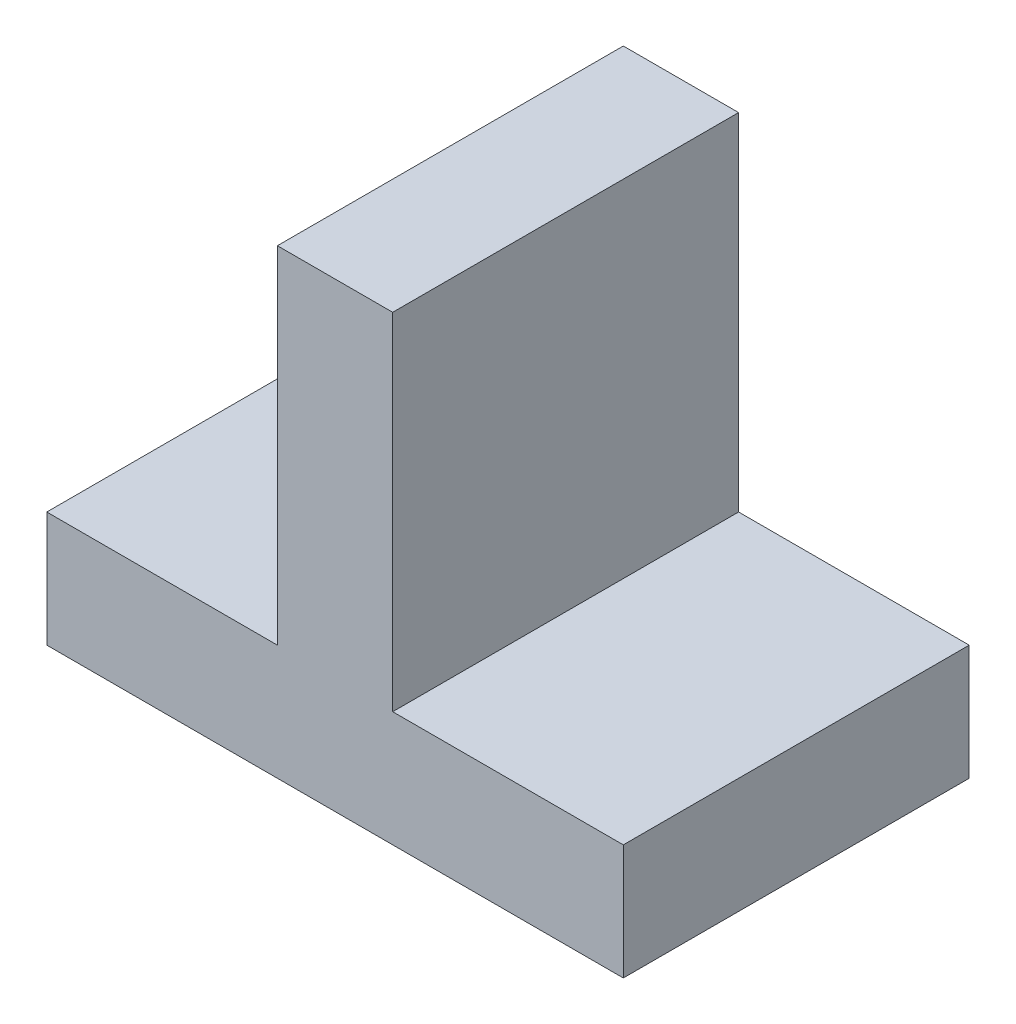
ISO-10303-21;
HEADER;
FILE_DESCRIPTION(('STEP AP214'),'2;1');
FILE_NAME('part.step','',(''),(''),'','','');
FILE_SCHEMA(('AUTOMOTIVE_DESIGN { 1 0 10303 214 1 1 1 1 }'));
ENDSEC;
DATA;
#1=APPLICATION_CONTEXT('core data for automotive mechanical design processes');
#2=APPLICATION_PROTOCOL_DEFINITION('international standard','automotive_design',2000,#1);
#3=PRODUCT_CONTEXT('',#1,'mechanical');
#4=PRODUCT('Part','Part','',(#3));
#5=PRODUCT_RELATED_PRODUCT_CATEGORY('part','',(#4));
#6=PRODUCT_DEFINITION_FORMATION('','',#4);
#7=PRODUCT_DEFINITION_CONTEXT('part definition',#1,'design');
#8=PRODUCT_DEFINITION('design','',#6,#7);
#9=PRODUCT_DEFINITION_SHAPE('','',#8);
#10=(LENGTH_UNIT() NAMED_UNIT(*) SI_UNIT(.MILLI.,.METRE.));
#11=(NAMED_UNIT(*) PLANE_ANGLE_UNIT() SI_UNIT($,.RADIAN.));
#12=(NAMED_UNIT(*) SI_UNIT($,.STERADIAN.) SOLID_ANGLE_UNIT());
#13=UNCERTAINTY_MEASURE_WITH_UNIT(LENGTH_MEASURE(1.E-05),#10,'distance_accuracy_value','');
#14=(GEOMETRIC_REPRESENTATION_CONTEXT(3) GLOBAL_UNCERTAINTY_ASSIGNED_CONTEXT((#13)) GLOBAL_UNIT_ASSIGNED_CONTEXT((#10,
#11,#12)) REPRESENTATION_CONTEXT('',''));
#15=CARTESIAN_POINT('',(0.,0.,0.));
#16=DIRECTION('',(0.,0.,1.));
#17=DIRECTION('',(1.,0.,0.));
#18=AXIS2_PLACEMENT_3D('',#15,#16,#17);
#19=CARTESIAN_POINT('',(0.,10.,0.));
#20=DIRECTION('',(0.,-1.,0.));
#21=DIRECTION('',(0.,0.,-1.));
#22=AXIS2_PLACEMENT_3D('',#19,#20,#21);
#23=PLANE('',#22);
#24=DIRECTION('',(0.,0.,-1.));
#25=VECTOR('',#24,1.);
#26=CARTESIAN_POINT('',(5.,10.,15.));
#27=LINE('',#26,#25);
#28=CARTESIAN_POINT('',(5.,10.,15.));
#29=VERTEX_POINT('',#28);
#30=CARTESIAN_POINT('',(5.,10.,-15.));
#31=VERTEX_POINT('',#30);
#32=EDGE_CURVE('E125',#29,#31,#27,.T.);
#33=ORIENTED_EDGE('',*,*,#32,.F.);
#34=DIRECTION('',(1.,0.,0.));
#35=VECTOR('',#34,1.);
#36=CARTESIAN_POINT('',(-25.,10.,15.));
#37=LINE('',#36,#35);
#38=CARTESIAN_POINT('',(25.,10.,15.));
#39=VERTEX_POINT('',#38);
#40=EDGE_CURVE('E57',#29,#39,#37,.T.);
#41=ORIENTED_EDGE('',*,*,#40,.T.);
#42=DIRECTION('',(0.,0.,-1.));
#43=VECTOR('',#42,1.);
#44=CARTESIAN_POINT('',(25.,10.,15.));
#45=LINE('',#44,#43);
#46=CARTESIAN_POINT('',(25.,10.,-15.));
#47=VERTEX_POINT('',#46);
#48=EDGE_CURVE('E144',#39,#47,#45,.T.);
#49=ORIENTED_EDGE('',*,*,#48,.T.);
#50=DIRECTION('',(-1.,0.,0.));
#51=VECTOR('',#50,1.);
#52=CARTESIAN_POINT('',(-25.,10.,-15.));
#53=LINE('',#52,#51);
#54=EDGE_CURVE('E86',#47,#31,#53,.T.);
#55=ORIENTED_EDGE('',*,*,#54,.T.);
#56=EDGE_LOOP('',(#33,#41,#49,#55));
#57=FACE_BOUND('',#56,.T.);
#58=ADVANCED_FACE('F33',(#57),#23,.F.);
#59=CARTESIAN_POINT('',(25.,10.,15.));
#60=DIRECTION('',(-1.,0.,0.));
#61=DIRECTION('',(0.,0.,1.));
#62=AXIS2_PLACEMENT_3D('',#59,#60,#61);
#63=PLANE('',#62);
#64=DIRECTION('',(0.,0.,-1.));
#65=VECTOR('',#64,1.);
#66=CARTESIAN_POINT('',(25.,0.,15.));
#67=LINE('',#66,#65);
#68=CARTESIAN_POINT('',(25.,0.,15.));
#69=VERTEX_POINT('',#68);
#70=CARTESIAN_POINT('',(25.,0.,-15.));
#71=VERTEX_POINT('',#70);
#72=EDGE_CURVE('E124',#69,#71,#67,.T.);
#73=ORIENTED_EDGE('',*,*,#72,.T.);
#74=DIRECTION('',(0.,-1.,0.));
#75=VECTOR('',#74,1.);
#76=CARTESIAN_POINT('',(25.,10.,-15.));
#77=LINE('',#76,#75);
#78=EDGE_CURVE('E11',#47,#71,#77,.T.);
#79=ORIENTED_EDGE('',*,*,#78,.F.);
#80=ORIENTED_EDGE('',*,*,#48,.F.);
#81=DIRECTION('',(0.,-1.,0.));
#82=VECTOR('',#81,1.);
#83=CARTESIAN_POINT('',(25.,10.,15.));
#84=LINE('',#83,#82);
#85=EDGE_CURVE('E131',#39,#69,#84,.T.);
#86=ORIENTED_EDGE('',*,*,#85,.T.);
#87=EDGE_LOOP('',(#73,#79,#80,#86));
#88=FACE_BOUND('',#87,.T.);
#89=ADVANCED_FACE('F35',(#88),#63,.F.);
#90=CARTESIAN_POINT('',(-25.,10.,-15.));
#91=DIRECTION('',(0.,0.,1.));
#92=DIRECTION('',(1.,0.,0.));
#93=AXIS2_PLACEMENT_3D('',#90,#91,#92);
#94=PLANE('',#93);
#95=DIRECTION('',(-1.,0.,0.));
#96=VECTOR('',#95,1.);
#97=CARTESIAN_POINT('',(-25.,0.,-15.));
#98=LINE('',#97,#96);
#99=CARTESIAN_POINT('',(-25.,0.,-15.));
#100=VERTEX_POINT('',#99);
#101=EDGE_CURVE('E140',#71,#100,#98,.T.);
#102=ORIENTED_EDGE('',*,*,#101,.T.);
#103=DIRECTION('',(0.,-1.,0.));
#104=VECTOR('',#103,1.);
#105=CARTESIAN_POINT('',(-25.,10.,-15.));
#106=LINE('',#105,#104);
#107=CARTESIAN_POINT('',(-25.,10.,-15.));
#108=VERTEX_POINT('',#107);
#109=EDGE_CURVE('E41',#108,#100,#106,.T.);
#110=ORIENTED_EDGE('',*,*,#109,.F.);
#111=CARTESIAN_POINT('',(-5.,10.,-15.));
#112=VERTEX_POINT('',#111);
#113=EDGE_CURVE('E176',#112,#108,#53,.T.);
#114=ORIENTED_EDGE('',*,*,#113,.F.);
#115=DIRECTION('',(0.,-1.,0.));
#116=VECTOR('',#115,1.);
#117=CARTESIAN_POINT('',(-5.,40.,-15.));
#118=LINE('',#117,#116);
#119=CARTESIAN_POINT('',(-5.,40.,-15.));
#120=VERTEX_POINT('',#119);
#121=EDGE_CURVE('E48',#120,#112,#118,.T.);
#122=ORIENTED_EDGE('',*,*,#121,.F.);
#123=DIRECTION('',(-1.,0.,0.));
#124=VECTOR('',#123,1.);
#125=CARTESIAN_POINT('',(-5.,40.,-15.));
#126=LINE('',#125,#124);
#127=CARTESIAN_POINT('',(5.,40.,-15.));
#128=VERTEX_POINT('',#127);
#129=EDGE_CURVE('E118',#128,#120,#126,.T.);
#130=ORIENTED_EDGE('',*,*,#129,.F.);
#131=DIRECTION('',(0.,1.,0.));
#132=VECTOR('',#131,1.);
#133=CARTESIAN_POINT('',(5.,40.,-15.));
#134=LINE('',#133,#132);
#135=EDGE_CURVE('E163',#31,#128,#134,.T.);
#136=ORIENTED_EDGE('',*,*,#135,.F.);
#137=ORIENTED_EDGE('',*,*,#54,.F.);
#138=ORIENTED_EDGE('',*,*,#78,.T.);
#139=EDGE_LOOP('',(#102,#110,#114,#122,#130,#136,#137,#138));
#140=FACE_BOUND('',#139,.T.);
#141=ADVANCED_FACE('F177',(#140),#94,.F.);
#142=CARTESIAN_POINT('',(-25.,10.,15.));
#143=DIRECTION('',(1.,0.,0.));
#144=DIRECTION('',(0.,0.,-1.));
#145=AXIS2_PLACEMENT_3D('',#142,#143,#144);
#146=PLANE('',#145);
#147=DIRECTION('',(0.,0.,1.));
#148=VECTOR('',#147,1.);
#149=CARTESIAN_POINT('',(-25.,0.,15.));
#150=LINE('',#149,#148);
#151=CARTESIAN_POINT('',(-25.,0.,15.));
#152=VERTEX_POINT('',#151);
#153=EDGE_CURVE('E142',#100,#152,#150,.T.);
#154=ORIENTED_EDGE('',*,*,#153,.T.);
#155=DIRECTION('',(0.,-1.,0.));
#156=VECTOR('',#155,1.);
#157=CARTESIAN_POINT('',(-25.,10.,15.));
#158=LINE('',#157,#156);
#159=CARTESIAN_POINT('',(-25.,10.,15.));
#160=VERTEX_POINT('',#159);
#161=EDGE_CURVE('E133',#160,#152,#158,.T.);
#162=ORIENTED_EDGE('',*,*,#161,.F.);
#163=DIRECTION('',(0.,0.,1.));
#164=VECTOR('',#163,1.);
#165=CARTESIAN_POINT('',(-25.,10.,15.));
#166=LINE('',#165,#164);
#167=EDGE_CURVE('E129',#108,#160,#166,.T.);
#168=ORIENTED_EDGE('',*,*,#167,.F.);
#169=ORIENTED_EDGE('',*,*,#109,.T.);
#170=EDGE_LOOP('',(#154,#162,#168,#169));
#171=FACE_BOUND('',#170,.T.);
#172=ADVANCED_FACE('F150',(#171),#146,.F.);
#173=CARTESIAN_POINT('',(-25.,10.,15.));
#174=DIRECTION('',(0.,0.,-1.));
#175=DIRECTION('',(-1.,0.,0.));
#176=AXIS2_PLACEMENT_3D('',#173,#174,#175);
#177=PLANE('',#176);
#178=DIRECTION('',(1.,0.,0.));
#179=VECTOR('',#178,1.);
#180=CARTESIAN_POINT('',(-25.,0.,15.));
#181=LINE('',#180,#179);
#182=EDGE_CURVE('E79',#152,#69,#181,.T.);
#183=ORIENTED_EDGE('',*,*,#182,.T.);
#184=ORIENTED_EDGE('',*,*,#85,.F.);
#185=ORIENTED_EDGE('',*,*,#40,.F.);
#186=DIRECTION('',(0.,1.,0.));
#187=VECTOR('',#186,1.);
#188=CARTESIAN_POINT('',(5.,40.,15.));
#189=LINE('',#188,#187);
#190=CARTESIAN_POINT('',(5.,40.,15.));
#191=VERTEX_POINT('',#190);
#192=EDGE_CURVE('E117',#29,#191,#189,.T.);
#193=ORIENTED_EDGE('',*,*,#192,.T.);
#194=DIRECTION('',(-1.,0.,0.));
#195=VECTOR('',#194,1.);
#196=CARTESIAN_POINT('',(-5.,40.,15.));
#197=LINE('',#196,#195);
#198=CARTESIAN_POINT('',(-5.,40.,15.));
#199=VERTEX_POINT('',#198);
#200=EDGE_CURVE('E115',#191,#199,#197,.T.);
#201=ORIENTED_EDGE('',*,*,#200,.T.);
#202=DIRECTION('',(0.,-1.,0.));
#203=VECTOR('',#202,1.);
#204=CARTESIAN_POINT('',(-5.,40.,15.));
#205=LINE('',#204,#203);
#206=CARTESIAN_POINT('',(-5.,10.,15.));
#207=VERTEX_POINT('',#206);
#208=EDGE_CURVE('E110',#199,#207,#205,.T.);
#209=ORIENTED_EDGE('',*,*,#208,.T.);
#210=EDGE_CURVE('E113',#160,#207,#37,.T.);
#211=ORIENTED_EDGE('',*,*,#210,.F.);
#212=ORIENTED_EDGE('',*,*,#161,.T.);
#213=EDGE_LOOP('',(#183,#184,#185,#193,#201,#209,#211,#212));
#214=FACE_BOUND('',#213,.T.);
#215=ADVANCED_FACE('F111',(#214),#177,.F.);
#216=ORIENTED_EDGE('',*,*,#210,.T.);
#217=DIRECTION('',(0.,0.,-1.));
#218=VECTOR('',#217,1.);
#219=CARTESIAN_POINT('',(-5.,10.,15.));
#220=LINE('',#219,#218);
#221=EDGE_CURVE('E120',#207,#112,#220,.T.);
#222=ORIENTED_EDGE('',*,*,#221,.T.);
#223=ORIENTED_EDGE('',*,*,#113,.T.);
#224=ORIENTED_EDGE('',*,*,#167,.T.);
#225=EDGE_LOOP('',(#216,#222,#223,#224));
#226=FACE_BOUND('',#225,.T.);
#227=ADVANCED_FACE('F127',(#226),#23,.F.);
#228=CARTESIAN_POINT('',(0.,0.,0.));
#229=DIRECTION('',(0.,-1.,0.));
#230=DIRECTION('',(0.,0.,-1.));
#231=AXIS2_PLACEMENT_3D('',#228,#229,#230);
#232=PLANE('',#231);
#233=ORIENTED_EDGE('',*,*,#72,.F.);
#234=ORIENTED_EDGE('',*,*,#182,.F.);
#235=ORIENTED_EDGE('',*,*,#153,.F.);
#236=ORIENTED_EDGE('',*,*,#101,.F.);
#237=EDGE_LOOP('',(#233,#234,#235,#236));
#238=FACE_BOUND('',#237,.T.);
#239=ADVANCED_FACE('F153',(#238),#232,.T.);
#240=CARTESIAN_POINT('',(-5.,40.,15.));
#241=DIRECTION('',(1.,0.,0.));
#242=DIRECTION('',(0.,1.,0.));
#243=AXIS2_PLACEMENT_3D('',#240,#241,#242);
#244=PLANE('',#243);
#245=ORIENTED_EDGE('',*,*,#121,.T.);
#246=ORIENTED_EDGE('',*,*,#221,.F.);
#247=ORIENTED_EDGE('',*,*,#208,.F.);
#248=DIRECTION('',(0.,0.,-1.));
#249=VECTOR('',#248,1.);
#250=CARTESIAN_POINT('',(-5.,40.,15.));
#251=LINE('',#250,#249);
#252=EDGE_CURVE('E166',#199,#120,#251,.T.);
#253=ORIENTED_EDGE('',*,*,#252,.T.);
#254=EDGE_LOOP('',(#245,#246,#247,#253));
#255=FACE_BOUND('',#254,.T.);
#256=ADVANCED_FACE('F121',(#255),#244,.F.);
#257=CARTESIAN_POINT('',(5.,40.,15.));
#258=DIRECTION('',(-1.,0.,0.));
#259=DIRECTION('',(0.,-1.,0.));
#260=AXIS2_PLACEMENT_3D('',#257,#258,#259);
#261=PLANE('',#260);
#262=ORIENTED_EDGE('',*,*,#135,.T.);
#263=DIRECTION('',(0.,0.,-1.));
#264=VECTOR('',#263,1.);
#265=CARTESIAN_POINT('',(5.,40.,15.));
#266=LINE('',#265,#264);
#267=EDGE_CURVE('E161',#191,#128,#266,.T.);
#268=ORIENTED_EDGE('',*,*,#267,.F.);
#269=ORIENTED_EDGE('',*,*,#192,.F.);
#270=ORIENTED_EDGE('',*,*,#32,.T.);
#271=EDGE_LOOP('',(#262,#268,#269,#270));
#272=FACE_BOUND('',#271,.T.);
#273=ADVANCED_FACE('F162',(#272),#261,.F.);
#274=CARTESIAN_POINT('',(-5.,40.,15.));
#275=DIRECTION('',(0.,-1.,0.));
#276=DIRECTION('',(0.,0.,-1.));
#277=AXIS2_PLACEMENT_3D('',#274,#275,#276);
#278=PLANE('',#277);
#279=ORIENTED_EDGE('',*,*,#129,.T.);
#280=ORIENTED_EDGE('',*,*,#252,.F.);
#281=ORIENTED_EDGE('',*,*,#200,.F.);
#282=ORIENTED_EDGE('',*,*,#267,.T.);
#283=EDGE_LOOP('',(#279,#280,#281,#282));
#284=FACE_BOUND('',#283,.T.);
#285=ADVANCED_FACE('F168',(#284),#278,.F.);
#286=CLOSED_SHELL('',(#58,#89,#141,#172,#215,#227,#239,#256,#273,#285));
#287=MANIFOLD_SOLID_BREP('B2',#286);
#288=ADVANCED_BREP_SHAPE_REPRESENTATION('',(#18,#287),#14);
#289=SHAPE_DEFINITION_REPRESENTATION(#9,#288);
ENDSEC;
END-ISO-10303-21;
